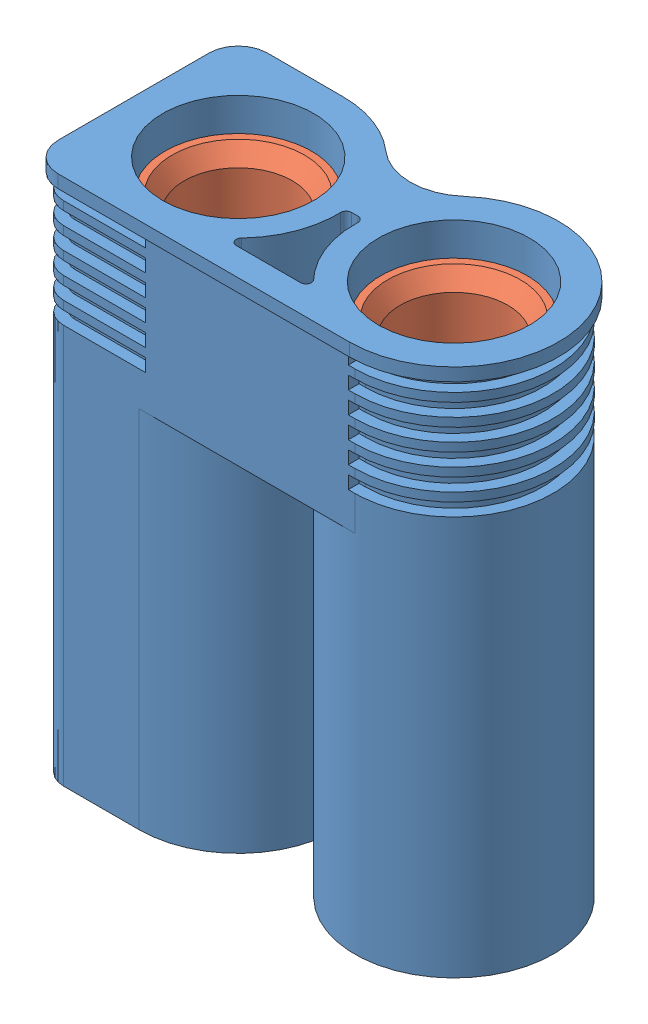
SolidWorks assembly EC5-Male-connector.sldasm, configuration Default (file format 9000). Lengths in mm.
Overall size (19.7 24.7 9.7).
3 component instances, 2 part files, 0 mates.
Components (placement in the parent):
- EC5 Male housing-1: EC5 Male housing.sldprt [Default] at origin size (19.7 24.7 9.7)
- EC3 Male contact-1: EC3 Male contact.sldprt [Default] at (0 1.0746 0) x (0 -1 0) z (0.48873 0 0.872435) size (22.29 6.79 6.79)
- EC3 Male contact-2: EC3 Male contact.sldprt [Default] at (10 1.0746 0) x (0 -1 0) z (0.644387 0 0.764699) size (22.29 6.79 6.79)
